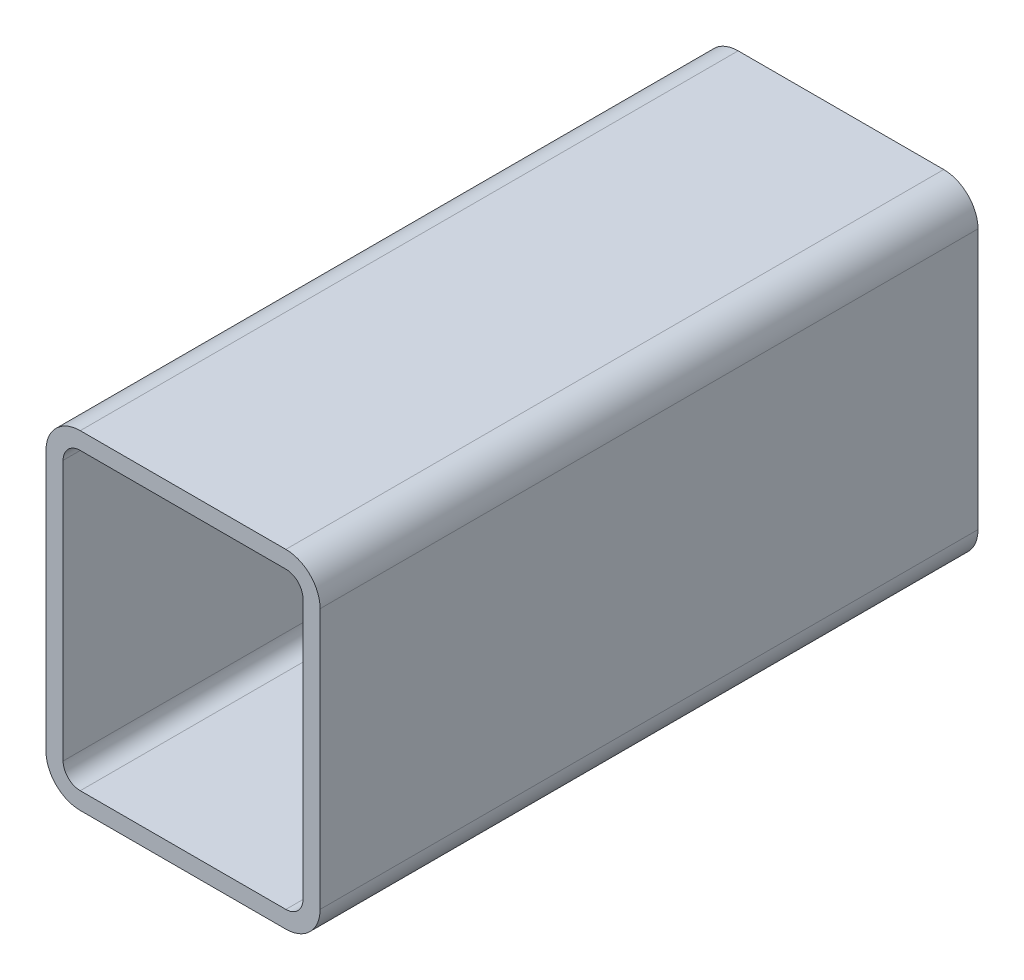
ISO-10303-21;
HEADER;
FILE_DESCRIPTION(('STEP AP214'),'2;1');
FILE_NAME('part.step','',(''),(''),'','','');
FILE_SCHEMA(('AUTOMOTIVE_DESIGN { 1 0 10303 214 1 1 1 1 }'));
ENDSEC;
DATA;
#1=APPLICATION_CONTEXT('core data for automotive mechanical design processes');
#2=APPLICATION_PROTOCOL_DEFINITION('international standard','automotive_design',2000,#1);
#3=PRODUCT_CONTEXT('',#1,'mechanical');
#4=PRODUCT('Part','Part','',(#3));
#5=PRODUCT_RELATED_PRODUCT_CATEGORY('part','',(#4));
#6=PRODUCT_DEFINITION_FORMATION('','',#4);
#7=PRODUCT_DEFINITION_CONTEXT('part definition',#1,'design');
#8=PRODUCT_DEFINITION('design','',#6,#7);
#9=PRODUCT_DEFINITION_SHAPE('','',#8);
#10=(LENGTH_UNIT() NAMED_UNIT(*) SI_UNIT(.MILLI.,.METRE.));
#11=(NAMED_UNIT(*) PLANE_ANGLE_UNIT() SI_UNIT($,.RADIAN.));
#12=(NAMED_UNIT(*) SI_UNIT($,.STERADIAN.) SOLID_ANGLE_UNIT());
#13=UNCERTAINTY_MEASURE_WITH_UNIT(LENGTH_MEASURE(1.E-05),#10,'distance_accuracy_value','');
#14=(GEOMETRIC_REPRESENTATION_CONTEXT(3) GLOBAL_UNCERTAINTY_ASSIGNED_CONTEXT((#13)) GLOBAL_UNIT_ASSIGNED_CONTEXT((#10,
#11,#12)) REPRESENTATION_CONTEXT('',''));
#15=CARTESIAN_POINT('',(0.,0.,0.));
#16=DIRECTION('',(0.,0.,1.));
#17=DIRECTION('',(1.,0.,0.));
#18=AXIS2_PLACEMENT_3D('',#15,#16,#17);
#19=CARTESIAN_POINT('',(16.7362396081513,138.536948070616,304.8));
#20=DIRECTION('',(0.,0.,1.));
#21=DIRECTION('',(1.,0.,0.));
#22=AXIS2_PLACEMENT_3D('',#19,#20,#21);
#23=PLANE('',#22);
#24=CARTESIAN_POINT('',(16.7362396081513,138.536948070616,304.8));
#25=DIRECTION('',(0.,0.,1.));
#26=DIRECTION('',(1.,0.,0.));
#27=AXIS2_PLACEMENT_3D('',#24,#25,#26);
#28=CIRCLE('',#27,15.875);
#29=CARTESIAN_POINT('',(16.7362396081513,154.411948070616,304.8));
#30=VERTEX_POINT('',#29);
#31=CARTESIAN_POINT('',(0.8612396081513,138.536948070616,304.8));
#32=VERTEX_POINT('',#31);
#33=EDGE_CURVE('E211',#30,#32,#28,.T.);
#34=ORIENTED_EDGE('',*,*,#33,.T.);
#35=DIRECTION('',(0.,-1.,0.));
#36=VECTOR('',#35,1.);
#37=CARTESIAN_POINT('',(0.8612396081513,17.8869480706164,304.8));
#38=LINE('',#37,#36);
#39=CARTESIAN_POINT('',(0.8612396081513,17.8869480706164,304.8));
#40=VERTEX_POINT('',#39);
#41=EDGE_CURVE('E214',#32,#40,#38,.T.);
#42=ORIENTED_EDGE('',*,*,#41,.T.);
#43=CARTESIAN_POINT('',(16.7362396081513,17.8869480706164,304.8));
#44=DIRECTION('',(0.,0.,1.));
#45=DIRECTION('',(1.,0.,0.));
#46=AXIS2_PLACEMENT_3D('',#43,#44,#45);
#47=CIRCLE('',#46,15.875);
#48=CARTESIAN_POINT('',(16.7362396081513,2.01194807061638,304.8));
#49=VERTEX_POINT('',#48);
#50=EDGE_CURVE('E217',#40,#49,#47,.T.);
#51=ORIENTED_EDGE('',*,*,#50,.T.);
#52=DIRECTION('',(1.,0.,0.));
#53=VECTOR('',#52,1.);
#54=CARTESIAN_POINT('',(111.986239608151,2.01194807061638,304.8));
#55=LINE('',#54,#53);
#56=CARTESIAN_POINT('',(111.986239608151,2.01194807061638,304.8));
#57=VERTEX_POINT('',#56);
#58=EDGE_CURVE('E219',#49,#57,#55,.T.);
#59=ORIENTED_EDGE('',*,*,#58,.T.);
#60=CARTESIAN_POINT('',(111.986239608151,17.8869480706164,304.8));
#61=DIRECTION('',(0.,0.,1.));
#62=DIRECTION('',(1.,0.,0.));
#63=AXIS2_PLACEMENT_3D('',#60,#61,#62);
#64=CIRCLE('',#63,15.875);
#65=CARTESIAN_POINT('',(127.861239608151,17.8869480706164,304.8));
#66=VERTEX_POINT('',#65);
#67=EDGE_CURVE('E221',#57,#66,#64,.T.);
#68=ORIENTED_EDGE('',*,*,#67,.T.);
#69=DIRECTION('',(0.,1.,0.));
#70=VECTOR('',#69,1.);
#71=CARTESIAN_POINT('',(127.861239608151,138.536948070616,304.8));
#72=LINE('',#71,#70);
#73=CARTESIAN_POINT('',(127.861239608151,138.536948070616,304.8));
#74=VERTEX_POINT('',#73);
#75=EDGE_CURVE('E223',#66,#74,#72,.T.);
#76=ORIENTED_EDGE('',*,*,#75,.T.);
#77=CARTESIAN_POINT('',(111.986239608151,138.536948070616,304.8));
#78=DIRECTION('',(0.,0.,1.));
#79=DIRECTION('',(1.,0.,0.));
#80=AXIS2_PLACEMENT_3D('',#77,#78,#79);
#81=CIRCLE('',#80,15.875);
#82=CARTESIAN_POINT('',(111.986239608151,154.411948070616,304.8));
#83=VERTEX_POINT('',#82);
#84=EDGE_CURVE('E225',#74,#83,#81,.T.);
#85=ORIENTED_EDGE('',*,*,#84,.T.);
#86=DIRECTION('',(-1.,0.,0.));
#87=VECTOR('',#86,1.);
#88=CARTESIAN_POINT('',(16.7362396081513,154.411948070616,304.8));
#89=LINE('',#88,#87);
#90=EDGE_CURVE('E227',#83,#30,#89,.T.);
#91=ORIENTED_EDGE('',*,*,#90,.T.);
#92=EDGE_LOOP('',(#34,#42,#51,#59,#68,#76,#85,#91));
#93=FACE_BOUND('',#92,.T.);
#94=DIRECTION('',(0.,-1.,0.));
#95=VECTOR('',#94,1.);
#96=CARTESIAN_POINT('',(8.7987396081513,17.8869480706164,304.8));
#97=LINE('',#96,#95);
#98=CARTESIAN_POINT('',(8.7987396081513,138.536948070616,304.8));
#99=VERTEX_POINT('',#98);
#100=CARTESIAN_POINT('',(8.7987396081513,17.8869480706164,304.8));
#101=VERTEX_POINT('',#100);
#102=EDGE_CURVE('E154',#99,#101,#97,.T.);
#103=ORIENTED_EDGE('',*,*,#102,.F.);
#104=CARTESIAN_POINT('',(16.7362396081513,138.536948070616,304.8));
#105=DIRECTION('',(0.,0.,1.));
#106=DIRECTION('',(1.,0.,0.));
#107=AXIS2_PLACEMENT_3D('',#104,#105,#106);
#108=CIRCLE('',#107,7.93750000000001);
#109=CARTESIAN_POINT('',(16.7362396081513,146.474448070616,304.8));
#110=VERTEX_POINT('',#109);
#111=EDGE_CURVE('E146',#110,#99,#108,.T.);
#112=ORIENTED_EDGE('',*,*,#111,.F.);
#113=DIRECTION('',(-1.,0.,0.));
#114=VECTOR('',#113,1.);
#115=CARTESIAN_POINT('',(16.7362396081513,146.474448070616,304.8));
#116=LINE('',#115,#114);
#117=CARTESIAN_POINT('',(111.986239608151,146.474448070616,304.8));
#118=VERTEX_POINT('',#117);
#119=EDGE_CURVE('E179',#118,#110,#116,.T.);
#120=ORIENTED_EDGE('',*,*,#119,.F.);
#121=CARTESIAN_POINT('',(111.986239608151,138.536948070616,304.8));
#122=DIRECTION('',(0.,0.,1.));
#123=DIRECTION('',(1.,0.,0.));
#124=AXIS2_PLACEMENT_3D('',#121,#122,#123);
#125=CIRCLE('',#124,7.93750000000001);
#126=CARTESIAN_POINT('',(119.923739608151,138.536948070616,304.8));
#127=VERTEX_POINT('',#126);
#128=EDGE_CURVE('E177',#127,#118,#125,.T.);
#129=ORIENTED_EDGE('',*,*,#128,.F.);
#130=DIRECTION('',(0.,1.,0.));
#131=VECTOR('',#130,1.);
#132=CARTESIAN_POINT('',(119.923739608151,138.536948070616,304.8));
#133=LINE('',#132,#131);
#134=CARTESIAN_POINT('',(119.923739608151,17.8869480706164,304.8));
#135=VERTEX_POINT('',#134);
#136=EDGE_CURVE('E175',#135,#127,#133,.T.);
#137=ORIENTED_EDGE('',*,*,#136,.F.);
#138=CARTESIAN_POINT('',(111.986239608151,17.8869480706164,304.8));
#139=DIRECTION('',(0.,0.,1.));
#140=DIRECTION('',(1.,0.,0.));
#141=AXIS2_PLACEMENT_3D('',#138,#139,#140);
#142=CIRCLE('',#141,7.9375);
#143=CARTESIAN_POINT('',(111.986239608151,9.94944807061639,304.8));
#144=VERTEX_POINT('',#143);
#145=EDGE_CURVE('E173',#144,#135,#142,.T.);
#146=ORIENTED_EDGE('',*,*,#145,.F.);
#147=DIRECTION('',(1.,0.,0.));
#148=VECTOR('',#147,1.);
#149=CARTESIAN_POINT('',(111.986239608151,9.94944807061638,304.8));
#150=LINE('',#149,#148);
#151=CARTESIAN_POINT('',(16.7362396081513,9.94944807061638,304.8));
#152=VERTEX_POINT('',#151);
#153=EDGE_CURVE('E169',#152,#144,#150,.T.);
#154=ORIENTED_EDGE('',*,*,#153,.F.);
#155=CARTESIAN_POINT('',(16.7362396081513,17.8869480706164,304.8));
#156=DIRECTION('',(0.,0.,1.));
#157=DIRECTION('',(1.,0.,0.));
#158=AXIS2_PLACEMENT_3D('',#155,#156,#157);
#159=CIRCLE('',#158,7.9375);
#160=EDGE_CURVE('E167',#101,#152,#159,.T.);
#161=ORIENTED_EDGE('',*,*,#160,.F.);
#162=EDGE_LOOP('',(#103,#112,#120,#129,#137,#146,#154,#161));
#163=FACE_BOUND('',#162,.T.);
#164=ADVANCED_FACE('F33',(#93,#163),#23,.T.);
#165=CARTESIAN_POINT('',(16.7362396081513,138.536948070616,0.));
#166=DIRECTION('',(0.,0.,1.));
#167=DIRECTION('',(1.,0.,0.));
#168=AXIS2_PLACEMENT_3D('',#165,#166,#167);
#169=PLANE('',#168);
#170=CARTESIAN_POINT('',(16.7362396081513,138.536948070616,0.));
#171=DIRECTION('',(0.,0.,1.));
#172=DIRECTION('',(1.,0.,0.));
#173=AXIS2_PLACEMENT_3D('',#170,#171,#172);
#174=CIRCLE('',#173,15.875);
#175=CARTESIAN_POINT('',(16.7362396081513,154.411948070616,0.));
#176=VERTEX_POINT('',#175);
#177=CARTESIAN_POINT('',(0.8612396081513,138.536948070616,0.));
#178=VERTEX_POINT('',#177);
#179=EDGE_CURVE('E162',#176,#178,#174,.T.);
#180=ORIENTED_EDGE('',*,*,#179,.F.);
#181=DIRECTION('',(-1.,0.,0.));
#182=VECTOR('',#181,1.);
#183=CARTESIAN_POINT('',(16.7362396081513,154.411948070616,0.));
#184=LINE('',#183,#182);
#185=CARTESIAN_POINT('',(111.986239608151,154.411948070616,0.));
#186=VERTEX_POINT('',#185);
#187=EDGE_CURVE('E215',#186,#176,#184,.T.);
#188=ORIENTED_EDGE('',*,*,#187,.F.);
#189=CARTESIAN_POINT('',(111.986239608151,138.536948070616,0.));
#190=DIRECTION('',(0.,0.,1.));
#191=DIRECTION('',(1.,0.,0.));
#192=AXIS2_PLACEMENT_3D('',#189,#190,#191);
#193=CIRCLE('',#192,15.875);
#194=CARTESIAN_POINT('',(127.861239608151,138.536948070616,0.));
#195=VERTEX_POINT('',#194);
#196=EDGE_CURVE('E242',#195,#186,#193,.T.);
#197=ORIENTED_EDGE('',*,*,#196,.F.);
#198=DIRECTION('',(0.,1.,0.));
#199=VECTOR('',#198,1.);
#200=CARTESIAN_POINT('',(127.861239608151,138.536948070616,0.));
#201=LINE('',#200,#199);
#202=CARTESIAN_POINT('',(127.861239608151,17.8869480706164,0.));
#203=VERTEX_POINT('',#202);
#204=EDGE_CURVE('E240',#203,#195,#201,.T.);
#205=ORIENTED_EDGE('',*,*,#204,.F.);
#206=CARTESIAN_POINT('',(111.986239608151,17.8869480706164,0.));
#207=DIRECTION('',(0.,0.,1.));
#208=DIRECTION('',(1.,0.,0.));
#209=AXIS2_PLACEMENT_3D('',#206,#207,#208);
#210=CIRCLE('',#209,15.875);
#211=CARTESIAN_POINT('',(111.986239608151,2.01194807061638,0.));
#212=VERTEX_POINT('',#211);
#213=EDGE_CURVE('E238',#212,#203,#210,.T.);
#214=ORIENTED_EDGE('',*,*,#213,.F.);
#215=DIRECTION('',(1.,0.,0.));
#216=VECTOR('',#215,1.);
#217=CARTESIAN_POINT('',(111.986239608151,2.01194807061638,0.));
#218=LINE('',#217,#216);
#219=CARTESIAN_POINT('',(16.7362396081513,2.01194807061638,0.));
#220=VERTEX_POINT('',#219);
#221=EDGE_CURVE('E236',#220,#212,#218,.T.);
#222=ORIENTED_EDGE('',*,*,#221,.F.);
#223=CARTESIAN_POINT('',(16.7362396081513,17.8869480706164,0.));
#224=DIRECTION('',(0.,0.,1.));
#225=DIRECTION('',(1.,0.,0.));
#226=AXIS2_PLACEMENT_3D('',#223,#224,#225);
#227=CIRCLE('',#226,15.875);
#228=CARTESIAN_POINT('',(0.8612396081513,17.8869480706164,0.));
#229=VERTEX_POINT('',#228);
#230=EDGE_CURVE('E234',#229,#220,#227,.T.);
#231=ORIENTED_EDGE('',*,*,#230,.F.);
#232=DIRECTION('',(0.,-1.,0.));
#233=VECTOR('',#232,1.);
#234=CARTESIAN_POINT('',(0.8612396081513,17.8869480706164,0.));
#235=LINE('',#234,#233);
#236=EDGE_CURVE('E232',#178,#229,#235,.T.);
#237=ORIENTED_EDGE('',*,*,#236,.F.);
#238=EDGE_LOOP('',(#180,#188,#197,#205,#214,#222,#231,#237));
#239=FACE_BOUND('',#238,.T.);
#240=CARTESIAN_POINT('',(16.7362396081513,138.536948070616,0.));
#241=DIRECTION('',(0.,0.,1.));
#242=DIRECTION('',(1.,0.,0.));
#243=AXIS2_PLACEMENT_3D('',#240,#241,#242);
#244=CIRCLE('',#243,7.93750000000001);
#245=CARTESIAN_POINT('',(16.7362396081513,146.474448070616,0.));
#246=VERTEX_POINT('',#245);
#247=CARTESIAN_POINT('',(8.7987396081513,138.536948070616,0.));
#248=VERTEX_POINT('',#247);
#249=EDGE_CURVE('E56',#246,#248,#244,.T.);
#250=ORIENTED_EDGE('',*,*,#249,.T.);
#251=DIRECTION('',(0.,-1.,0.));
#252=VECTOR('',#251,1.);
#253=CARTESIAN_POINT('',(8.7987396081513,17.8869480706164,0.));
#254=LINE('',#253,#252);
#255=CARTESIAN_POINT('',(8.7987396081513,17.8869480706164,0.));
#256=VERTEX_POINT('',#255);
#257=EDGE_CURVE('E161',#248,#256,#254,.T.);
#258=ORIENTED_EDGE('',*,*,#257,.T.);
#259=CARTESIAN_POINT('',(16.7362396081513,17.8869480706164,0.));
#260=DIRECTION('',(0.,0.,1.));
#261=DIRECTION('',(1.,0.,0.));
#262=AXIS2_PLACEMENT_3D('',#259,#260,#261);
#263=CIRCLE('',#262,7.9375);
#264=CARTESIAN_POINT('',(16.7362396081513,9.94944807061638,0.));
#265=VERTEX_POINT('',#264);
#266=EDGE_CURVE('E183',#256,#265,#263,.T.);
#267=ORIENTED_EDGE('',*,*,#266,.T.);
#268=DIRECTION('',(1.,0.,0.));
#269=VECTOR('',#268,1.);
#270=CARTESIAN_POINT('',(111.986239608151,9.94944807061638,0.));
#271=LINE('',#270,#269);
#272=CARTESIAN_POINT('',(111.986239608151,9.94944807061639,0.));
#273=VERTEX_POINT('',#272);
#274=EDGE_CURVE('E186',#265,#273,#271,.T.);
#275=ORIENTED_EDGE('',*,*,#274,.T.);
#276=CARTESIAN_POINT('',(111.986239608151,17.8869480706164,0.));
#277=DIRECTION('',(0.,0.,1.));
#278=DIRECTION('',(1.,0.,0.));
#279=AXIS2_PLACEMENT_3D('',#276,#277,#278);
#280=CIRCLE('',#279,7.9375);
#281=CARTESIAN_POINT('',(119.923739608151,17.8869480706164,0.));
#282=VERTEX_POINT('',#281);
#283=EDGE_CURVE('E189',#273,#282,#280,.T.);
#284=ORIENTED_EDGE('',*,*,#283,.T.);
#285=DIRECTION('',(0.,1.,0.));
#286=VECTOR('',#285,1.);
#287=CARTESIAN_POINT('',(119.923739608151,138.536948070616,0.));
#288=LINE('',#287,#286);
#289=CARTESIAN_POINT('',(119.923739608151,138.536948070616,0.));
#290=VERTEX_POINT('',#289);
#291=EDGE_CURVE('E192',#282,#290,#288,.T.);
#292=ORIENTED_EDGE('',*,*,#291,.T.);
#293=CARTESIAN_POINT('',(111.986239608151,138.536948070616,0.));
#294=DIRECTION('',(0.,0.,1.));
#295=DIRECTION('',(1.,0.,0.));
#296=AXIS2_PLACEMENT_3D('',#293,#294,#295);
#297=CIRCLE('',#296,7.93750000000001);
#298=CARTESIAN_POINT('',(111.986239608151,146.474448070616,0.));
#299=VERTEX_POINT('',#298);
#300=EDGE_CURVE('E195',#290,#299,#297,.T.);
#301=ORIENTED_EDGE('',*,*,#300,.T.);
#302=DIRECTION('',(-1.,0.,0.));
#303=VECTOR('',#302,1.);
#304=CARTESIAN_POINT('',(16.7362396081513,146.474448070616,0.));
#305=LINE('',#304,#303);
#306=EDGE_CURVE('E155',#299,#246,#305,.T.);
#307=ORIENTED_EDGE('',*,*,#306,.T.);
#308=EDGE_LOOP('',(#250,#258,#267,#275,#284,#292,#301,#307));
#309=FACE_BOUND('',#308,.T.);
#310=ADVANCED_FACE('F272',(#239,#309),#169,.F.);
#311=CARTESIAN_POINT('',(16.7362396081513,138.536948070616,304.8));
#312=DIRECTION('',(0.,0.,-1.));
#313=DIRECTION('',(-1.,0.,0.));
#314=AXIS2_PLACEMENT_3D('',#311,#312,#313);
#315=CYLINDRICAL_SURFACE('',#314,15.875);
#316=ORIENTED_EDGE('',*,*,#179,.T.);
#317=DIRECTION('',(0.,0.,-1.));
#318=VECTOR('',#317,1.);
#319=CARTESIAN_POINT('',(0.8612396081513,138.536948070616,304.8));
#320=LINE('',#319,#318);
#321=EDGE_CURVE('E11',#32,#178,#320,.T.);
#322=ORIENTED_EDGE('',*,*,#321,.F.);
#323=ORIENTED_EDGE('',*,*,#33,.F.);
#324=DIRECTION('',(0.,0.,-1.));
#325=VECTOR('',#324,1.);
#326=CARTESIAN_POINT('',(16.7362396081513,154.411948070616,304.8));
#327=LINE('',#326,#325);
#328=EDGE_CURVE('E229',#30,#176,#327,.T.);
#329=ORIENTED_EDGE('',*,*,#328,.T.);
#330=EDGE_LOOP('',(#316,#322,#323,#329));
#331=FACE_BOUND('',#330,.T.);
#332=ADVANCED_FACE('F35',(#331),#315,.T.);
#333=CARTESIAN_POINT('',(0.8612396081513,17.8869480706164,304.8));
#334=DIRECTION('',(1.,0.,0.));
#335=DIRECTION('',(0.,0.,-1.));
#336=AXIS2_PLACEMENT_3D('',#333,#334,#335);
#337=PLANE('',#336);
#338=ORIENTED_EDGE('',*,*,#236,.T.);
#339=DIRECTION('',(0.,0.,-1.));
#340=VECTOR('',#339,1.);
#341=CARTESIAN_POINT('',(0.8612396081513,17.8869480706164,304.8));
#342=LINE('',#341,#340);
#343=EDGE_CURVE('E41',#40,#229,#342,.T.);
#344=ORIENTED_EDGE('',*,*,#343,.F.);
#345=ORIENTED_EDGE('',*,*,#41,.F.);
#346=ORIENTED_EDGE('',*,*,#321,.T.);
#347=EDGE_LOOP('',(#338,#344,#345,#346));
#348=FACE_BOUND('',#347,.T.);
#349=ADVANCED_FACE('F289',(#348),#337,.F.);
#350=CARTESIAN_POINT('',(16.7362396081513,17.8869480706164,304.8));
#351=DIRECTION('',(0.,0.,-1.));
#352=DIRECTION('',(-1.,0.,0.));
#353=AXIS2_PLACEMENT_3D('',#350,#351,#352);
#354=CYLINDRICAL_SURFACE('',#353,15.875);
#355=ORIENTED_EDGE('',*,*,#230,.T.);
#356=DIRECTION('',(0.,0.,-1.));
#357=VECTOR('',#356,1.);
#358=CARTESIAN_POINT('',(16.7362396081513,2.01194807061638,304.8));
#359=LINE('',#358,#357);
#360=EDGE_CURVE('E259',#49,#220,#359,.T.);
#361=ORIENTED_EDGE('',*,*,#360,.F.);
#362=ORIENTED_EDGE('',*,*,#50,.F.);
#363=ORIENTED_EDGE('',*,*,#343,.T.);
#364=EDGE_LOOP('',(#355,#361,#362,#363));
#365=FACE_BOUND('',#364,.T.);
#366=ADVANCED_FACE('F266',(#365),#354,.T.);
#367=CARTESIAN_POINT('',(111.986239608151,2.01194807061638,304.8));
#368=DIRECTION('',(0.,1.,0.));
#369=DIRECTION('',(0.,0.,1.));
#370=AXIS2_PLACEMENT_3D('',#367,#368,#369);
#371=PLANE('',#370);
#372=ORIENTED_EDGE('',*,*,#221,.T.);
#373=DIRECTION('',(0.,0.,-1.));
#374=VECTOR('',#373,1.);
#375=CARTESIAN_POINT('',(111.986239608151,2.01194807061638,304.8));
#376=LINE('',#375,#374);
#377=EDGE_CURVE('E256',#57,#212,#376,.T.);
#378=ORIENTED_EDGE('',*,*,#377,.F.);
#379=ORIENTED_EDGE('',*,*,#58,.F.);
#380=ORIENTED_EDGE('',*,*,#360,.T.);
#381=EDGE_LOOP('',(#372,#378,#379,#380));
#382=FACE_BOUND('',#381,.T.);
#383=ADVANCED_FACE('F278',(#382),#371,.F.);
#384=CARTESIAN_POINT('',(111.986239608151,17.8869480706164,304.8));
#385=DIRECTION('',(0.,0.,-1.));
#386=DIRECTION('',(-1.,0.,0.));
#387=AXIS2_PLACEMENT_3D('',#384,#385,#386);
#388=CYLINDRICAL_SURFACE('',#387,15.875);
#389=ORIENTED_EDGE('',*,*,#213,.T.);
#390=DIRECTION('',(0.,0.,-1.));
#391=VECTOR('',#390,1.);
#392=CARTESIAN_POINT('',(127.861239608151,17.8869480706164,304.8));
#393=LINE('',#392,#391);
#394=EDGE_CURVE('E253',#66,#203,#393,.T.);
#395=ORIENTED_EDGE('',*,*,#394,.F.);
#396=ORIENTED_EDGE('',*,*,#67,.F.);
#397=ORIENTED_EDGE('',*,*,#377,.T.);
#398=EDGE_LOOP('',(#389,#395,#396,#397));
#399=FACE_BOUND('',#398,.T.);
#400=ADVANCED_FACE('F282',(#399),#388,.T.);
#401=CARTESIAN_POINT('',(127.861239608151,138.536948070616,304.8));
#402=DIRECTION('',(-1.,0.,0.));
#403=DIRECTION('',(0.,0.,1.));
#404=AXIS2_PLACEMENT_3D('',#401,#402,#403);
#405=PLANE('',#404);
#406=ORIENTED_EDGE('',*,*,#204,.T.);
#407=DIRECTION('',(0.,0.,-1.));
#408=VECTOR('',#407,1.);
#409=CARTESIAN_POINT('',(127.861239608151,138.536948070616,304.8));
#410=LINE('',#409,#408);
#411=EDGE_CURVE('E250',#74,#195,#410,.T.);
#412=ORIENTED_EDGE('',*,*,#411,.F.);
#413=ORIENTED_EDGE('',*,*,#75,.F.);
#414=ORIENTED_EDGE('',*,*,#394,.T.);
#415=EDGE_LOOP('',(#406,#412,#413,#414));
#416=FACE_BOUND('',#415,.T.);
#417=ADVANCED_FACE('F302',(#416),#405,.F.);
#418=CARTESIAN_POINT('',(111.986239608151,138.536948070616,304.8));
#419=DIRECTION('',(0.,0.,-1.));
#420=DIRECTION('',(-1.,0.,0.));
#421=AXIS2_PLACEMENT_3D('',#418,#419,#420);
#422=CYLINDRICAL_SURFACE('',#421,15.875);
#423=ORIENTED_EDGE('',*,*,#196,.T.);
#424=DIRECTION('',(0.,0.,-1.));
#425=VECTOR('',#424,1.);
#426=CARTESIAN_POINT('',(111.986239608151,154.411948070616,304.8));
#427=LINE('',#426,#425);
#428=EDGE_CURVE('E247',#83,#186,#427,.T.);
#429=ORIENTED_EDGE('',*,*,#428,.F.);
#430=ORIENTED_EDGE('',*,*,#84,.F.);
#431=ORIENTED_EDGE('',*,*,#411,.T.);
#432=EDGE_LOOP('',(#423,#429,#430,#431));
#433=FACE_BOUND('',#432,.T.);
#434=ADVANCED_FACE('F300',(#433),#422,.T.);
#435=CARTESIAN_POINT('',(16.7362396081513,154.411948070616,304.8));
#436=DIRECTION('',(0.,-1.,0.));
#437=DIRECTION('',(0.,0.,-1.));
#438=AXIS2_PLACEMENT_3D('',#435,#436,#437);
#439=PLANE('',#438);
#440=ORIENTED_EDGE('',*,*,#187,.T.);
#441=ORIENTED_EDGE('',*,*,#328,.F.);
#442=ORIENTED_EDGE('',*,*,#90,.F.);
#443=ORIENTED_EDGE('',*,*,#428,.T.);
#444=EDGE_LOOP('',(#440,#441,#442,#443));
#445=FACE_BOUND('',#444,.T.);
#446=ADVANCED_FACE('F295',(#445),#439,.F.);
#447=CARTESIAN_POINT('',(16.7362396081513,138.536948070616,304.8));
#448=DIRECTION('',(0.,0.,-1.));
#449=DIRECTION('',(-1.,0.,0.));
#450=AXIS2_PLACEMENT_3D('',#447,#448,#449);
#451=CYLINDRICAL_SURFACE('',#450,7.93750000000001);
#452=ORIENTED_EDGE('',*,*,#249,.F.);
#453=DIRECTION('',(0.,0.,-1.));
#454=VECTOR('',#453,1.);
#455=CARTESIAN_POINT('',(16.7362396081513,146.474448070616,304.8));
#456=LINE('',#455,#454);
#457=EDGE_CURVE('E150',#110,#246,#456,.T.);
#458=ORIENTED_EDGE('',*,*,#457,.F.);
#459=ORIENTED_EDGE('',*,*,#111,.T.);
#460=DIRECTION('',(0.,0.,-1.));
#461=VECTOR('',#460,1.);
#462=CARTESIAN_POINT('',(8.7987396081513,138.536948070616,304.8));
#463=LINE('',#462,#461);
#464=EDGE_CURVE('E149',#99,#248,#463,.T.);
#465=ORIENTED_EDGE('',*,*,#464,.T.);
#466=EDGE_LOOP('',(#452,#458,#459,#465));
#467=FACE_BOUND('',#466,.T.);
#468=ADVANCED_FACE('F148',(#467),#451,.F.);
#469=CARTESIAN_POINT('',(8.7987396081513,17.8869480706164,304.8));
#470=DIRECTION('',(1.,0.,0.));
#471=DIRECTION('',(0.,0.,-1.));
#472=AXIS2_PLACEMENT_3D('',#469,#470,#471);
#473=PLANE('',#472);
#474=ORIENTED_EDGE('',*,*,#257,.F.);
#475=ORIENTED_EDGE('',*,*,#464,.F.);
#476=ORIENTED_EDGE('',*,*,#102,.T.);
#477=DIRECTION('',(0.,0.,-1.));
#478=VECTOR('',#477,1.);
#479=CARTESIAN_POINT('',(8.7987396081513,17.8869480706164,304.8));
#480=LINE('',#479,#478);
#481=EDGE_CURVE('E163',#101,#256,#480,.T.);
#482=ORIENTED_EDGE('',*,*,#481,.T.);
#483=EDGE_LOOP('',(#474,#475,#476,#482));
#484=FACE_BOUND('',#483,.T.);
#485=ADVANCED_FACE('F158',(#484),#473,.T.);
#486=CARTESIAN_POINT('',(16.7362396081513,17.8869480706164,304.8));
#487=DIRECTION('',(0.,0.,-1.));
#488=DIRECTION('',(-1.,0.,0.));
#489=AXIS2_PLACEMENT_3D('',#486,#487,#488);
#490=CYLINDRICAL_SURFACE('',#489,7.9375);
#491=ORIENTED_EDGE('',*,*,#266,.F.);
#492=ORIENTED_EDGE('',*,*,#481,.F.);
#493=ORIENTED_EDGE('',*,*,#160,.T.);
#494=DIRECTION('',(0.,0.,-1.));
#495=VECTOR('',#494,1.);
#496=CARTESIAN_POINT('',(16.7362396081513,9.94944807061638,304.8));
#497=LINE('',#496,#495);
#498=EDGE_CURVE('E208',#152,#265,#497,.T.);
#499=ORIENTED_EDGE('',*,*,#498,.T.);
#500=EDGE_LOOP('',(#491,#492,#493,#499));
#501=FACE_BOUND('',#500,.T.);
#502=ADVANCED_FACE('F327',(#501),#490,.F.);
#503=CARTESIAN_POINT('',(111.986239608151,9.94944807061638,304.8));
#504=DIRECTION('',(0.,1.,0.));
#505=DIRECTION('',(0.,0.,1.));
#506=AXIS2_PLACEMENT_3D('',#503,#504,#505);
#507=PLANE('',#506);
#508=ORIENTED_EDGE('',*,*,#274,.F.);
#509=ORIENTED_EDGE('',*,*,#498,.F.);
#510=ORIENTED_EDGE('',*,*,#153,.T.);
#511=DIRECTION('',(0.,0.,-1.));
#512=VECTOR('',#511,1.);
#513=CARTESIAN_POINT('',(111.986239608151,9.94944807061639,304.8));
#514=LINE('',#513,#512);
#515=EDGE_CURVE('E206',#144,#273,#514,.T.);
#516=ORIENTED_EDGE('',*,*,#515,.T.);
#517=EDGE_LOOP('',(#508,#509,#510,#516));
#518=FACE_BOUND('',#517,.T.);
#519=ADVANCED_FACE('F331',(#518),#507,.T.);
#520=CARTESIAN_POINT('',(111.986239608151,17.8869480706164,304.8));
#521=DIRECTION('',(0.,0.,-1.));
#522=DIRECTION('',(-1.,0.,0.));
#523=AXIS2_PLACEMENT_3D('',#520,#521,#522);
#524=CYLINDRICAL_SURFACE('',#523,7.9375);
#525=ORIENTED_EDGE('',*,*,#283,.F.);
#526=ORIENTED_EDGE('',*,*,#515,.F.);
#527=ORIENTED_EDGE('',*,*,#145,.T.);
#528=DIRECTION('',(0.,0.,-1.));
#529=VECTOR('',#528,1.);
#530=CARTESIAN_POINT('',(119.923739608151,17.8869480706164,304.8));
#531=LINE('',#530,#529);
#532=EDGE_CURVE('E204',#135,#282,#531,.T.);
#533=ORIENTED_EDGE('',*,*,#532,.T.);
#534=EDGE_LOOP('',(#525,#526,#527,#533));
#535=FACE_BOUND('',#534,.T.);
#536=ADVANCED_FACE('F337',(#535),#524,.F.);
#537=CARTESIAN_POINT('',(119.923739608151,138.536948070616,304.8));
#538=DIRECTION('',(-1.,0.,0.));
#539=DIRECTION('',(0.,0.,1.));
#540=AXIS2_PLACEMENT_3D('',#537,#538,#539);
#541=PLANE('',#540);
#542=ORIENTED_EDGE('',*,*,#291,.F.);
#543=ORIENTED_EDGE('',*,*,#532,.F.);
#544=ORIENTED_EDGE('',*,*,#136,.T.);
#545=DIRECTION('',(0.,0.,-1.));
#546=VECTOR('',#545,1.);
#547=CARTESIAN_POINT('',(119.923739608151,138.536948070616,304.8));
#548=LINE('',#547,#546);
#549=EDGE_CURVE('E202',#127,#290,#548,.T.);
#550=ORIENTED_EDGE('',*,*,#549,.T.);
#551=EDGE_LOOP('',(#542,#543,#544,#550));
#552=FACE_BOUND('',#551,.T.);
#553=ADVANCED_FACE('F341',(#552),#541,.T.);
#554=CARTESIAN_POINT('',(111.986239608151,138.536948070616,304.8));
#555=DIRECTION('',(0.,0.,-1.));
#556=DIRECTION('',(-1.,0.,0.));
#557=AXIS2_PLACEMENT_3D('',#554,#555,#556);
#558=CYLINDRICAL_SURFACE('',#557,7.93750000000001);
#559=ORIENTED_EDGE('',*,*,#300,.F.);
#560=ORIENTED_EDGE('',*,*,#549,.F.);
#561=ORIENTED_EDGE('',*,*,#128,.T.);
#562=DIRECTION('',(0.,0.,-1.));
#563=VECTOR('',#562,1.);
#564=CARTESIAN_POINT('',(111.986239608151,146.474448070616,304.8));
#565=LINE('',#564,#563);
#566=EDGE_CURVE('E48',#118,#299,#565,.T.);
#567=ORIENTED_EDGE('',*,*,#566,.T.);
#568=EDGE_LOOP('',(#559,#560,#561,#567));
#569=FACE_BOUND('',#568,.T.);
#570=ADVANCED_FACE('F345',(#569),#558,.F.);
#571=CARTESIAN_POINT('',(16.7362396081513,146.474448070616,304.8));
#572=DIRECTION('',(0.,-1.,0.));
#573=DIRECTION('',(0.,0.,-1.));
#574=AXIS2_PLACEMENT_3D('',#571,#572,#573);
#575=PLANE('',#574);
#576=ORIENTED_EDGE('',*,*,#306,.F.);
#577=ORIENTED_EDGE('',*,*,#566,.F.);
#578=ORIENTED_EDGE('',*,*,#119,.T.);
#579=ORIENTED_EDGE('',*,*,#457,.T.);
#580=EDGE_LOOP('',(#576,#577,#578,#579));
#581=FACE_BOUND('',#580,.T.);
#582=ADVANCED_FACE('F349',(#581),#575,.T.);
#583=CLOSED_SHELL('',(#164,#310,#332,#349,#366,#383,#400,#417,#434,#446,#468,#485,#502,#519,
#536,#553,#570,#582));
#584=MANIFOLD_SOLID_BREP('B2',#583);
#585=ADVANCED_BREP_SHAPE_REPRESENTATION('',(#18,#584),#14);
#586=SHAPE_DEFINITION_REPRESENTATION(#9,#585);
ENDSEC;
END-ISO-10303-21;
